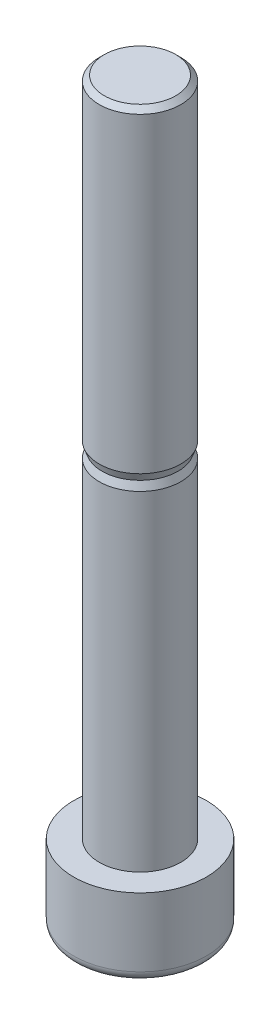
ISO-10303-21;
HEADER;
FILE_DESCRIPTION(('STEP AP214'),'2;1');
FILE_NAME('part.step','',(''),(''),'','','');
FILE_SCHEMA(('AUTOMOTIVE_DESIGN { 1 0 10303 214 1 1 1 1 }'));
ENDSEC;
DATA;
#1=APPLICATION_CONTEXT('core data for automotive mechanical design processes');
#2=APPLICATION_PROTOCOL_DEFINITION('international standard','automotive_design',2000,#1);
#3=PRODUCT_CONTEXT('',#1,'mechanical');
#4=PRODUCT('Part','Part','',(#3));
#5=PRODUCT_RELATED_PRODUCT_CATEGORY('part','',(#4));
#6=PRODUCT_DEFINITION_FORMATION('','',#4);
#7=PRODUCT_DEFINITION_CONTEXT('part definition',#1,'design');
#8=PRODUCT_DEFINITION('design','',#6,#7);
#9=PRODUCT_DEFINITION_SHAPE('','',#8);
#10=(LENGTH_UNIT() NAMED_UNIT(*) SI_UNIT(.MILLI.,.METRE.));
#11=(NAMED_UNIT(*) PLANE_ANGLE_UNIT() SI_UNIT($,.RADIAN.));
#12=(NAMED_UNIT(*) SI_UNIT($,.STERADIAN.) SOLID_ANGLE_UNIT());
#13=UNCERTAINTY_MEASURE_WITH_UNIT(LENGTH_MEASURE(1.E-05),#10,'distance_accuracy_value','');
#14=(GEOMETRIC_REPRESENTATION_CONTEXT(3) GLOBAL_UNCERTAINTY_ASSIGNED_CONTEXT((#13)) GLOBAL_UNIT_ASSIGNED_CONTEXT((#10,
#11,#12)) REPRESENTATION_CONTEXT('',''));
#15=CARTESIAN_POINT('',(0.,0.,0.));
#16=DIRECTION('',(0.,0.,1.));
#17=DIRECTION('',(1.,0.,0.));
#18=AXIS2_PLACEMENT_3D('',#15,#16,#17);
#19=CARTESIAN_POINT('',(0.,72.5,0.));
#20=DIRECTION('',(0.,1.,0.));
#21=DIRECTION('',(0.,0.,1.));
#22=AXIS2_PLACEMENT_3D('',#19,#20,#21);
#23=PLANE('',#22);
#24=CARTESIAN_POINT('',(0.,72.5,0.));
#25=DIRECTION('',(0.,-1.,0.));
#26=DIRECTION('',(0.,0.,-1.));
#27=AXIS2_PLACEMENT_3D('',#24,#25,#26);
#28=CIRCLE('',#27,3.5);
#29=CARTESIAN_POINT('',(0.,72.5,-3.5));
#30=VERTEX_POINT('',#29);
#31=EDGE_CURVE('E149',#30,#30,#28,.T.);
#32=ORIENTED_EDGE('',*,*,#31,.F.);
#33=EDGE_LOOP('',(#32));
#34=FACE_BOUND('',#33,.T.);
#35=ADVANCED_FACE('F47',(#34),#23,.T.);
#36=CARTESIAN_POINT('',(0.,72.,0.));
#37=DIRECTION('',(0.,-1.,0.));
#38=DIRECTION('',(0.,0.,-1.));
#39=AXIS2_PLACEMENT_3D('',#36,#37,#38);
#40=CONICAL_SURFACE('',#39,4.,0.785398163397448);
#41=ORIENTED_EDGE('',*,*,#31,.T.);
#42=EDGE_LOOP('',(#41));
#43=FACE_BOUND('',#42,.T.);
#44=CARTESIAN_POINT('',(0.,72.,0.));
#45=DIRECTION('',(0.,-1.,0.));
#46=DIRECTION('',(0.,0.,-1.));
#47=AXIS2_PLACEMENT_3D('',#44,#45,#46);
#48=CIRCLE('',#47,4.);
#49=CARTESIAN_POINT('',(0.,72.,-4.));
#50=VERTEX_POINT('',#49);
#51=EDGE_CURVE('E146',#50,#50,#48,.T.);
#52=ORIENTED_EDGE('',*,*,#51,.F.);
#53=EDGE_LOOP('',(#52));
#54=FACE_BOUND('',#53,.T.);
#55=ADVANCED_FACE('F177',(#43,#54),#40,.T.);
#56=CARTESIAN_POINT('',(0.,0.,0.));
#57=DIRECTION('',(0.,-1.,0.));
#58=DIRECTION('',(0.,0.,-1.));
#59=AXIS2_PLACEMENT_3D('',#56,#57,#58);
#60=CYLINDRICAL_SURFACE('',#59,4.);
#61=ORIENTED_EDGE('',*,*,#51,.T.);
#62=EDGE_LOOP('',(#61));
#63=FACE_BOUND('',#62,.T.);
#64=CARTESIAN_POINT('',(0.,41.5,0.));
#65=DIRECTION('',(0.,-1.,0.));
#66=DIRECTION('',(0.,0.,-1.));
#67=AXIS2_PLACEMENT_3D('',#64,#65,#66);
#68=CIRCLE('',#67,4.);
#69=CARTESIAN_POINT('',(0.,41.5,-4.));
#70=VERTEX_POINT('',#69);
#71=EDGE_CURVE('E143',#70,#70,#68,.T.);
#72=ORIENTED_EDGE('',*,*,#71,.F.);
#73=EDGE_LOOP('',(#72));
#74=FACE_BOUND('',#73,.T.);
#75=ADVANCED_FACE('F183',(#63,#74),#60,.T.);
#76=CARTESIAN_POINT('',(0.,40.75,0.));
#77=DIRECTION('',(0.,1.,0.));
#78=DIRECTION('',(0.,0.,1.));
#79=AXIS2_PLACEMENT_3D('',#76,#77,#78);
#80=CONICAL_SURFACE('',#79,3.72702232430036,0.34906585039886);
#81=ORIENTED_EDGE('',*,*,#71,.T.);
#82=EDGE_LOOP('',(#81));
#83=FACE_BOUND('',#82,.T.);
#84=CARTESIAN_POINT('',(0.,40.75,0.));
#85=DIRECTION('',(0.,-1.,0.));
#86=DIRECTION('',(0.,0.,-1.));
#87=AXIS2_PLACEMENT_3D('',#84,#85,#86);
#88=CIRCLE('',#87,3.72702232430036);
#89=CARTESIAN_POINT('',(0.,40.75,-3.72702232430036));
#90=VERTEX_POINT('',#89);
#91=EDGE_CURVE('E140',#90,#90,#88,.T.);
#92=ORIENTED_EDGE('',*,*,#91,.F.);
#93=EDGE_LOOP('',(#92));
#94=FACE_BOUND('',#93,.T.);
#95=ADVANCED_FACE('F190',(#83,#94),#80,.T.);
#96=CARTESIAN_POINT('',(0.,40.,0.));
#97=DIRECTION('',(0.,-1.,0.));
#98=DIRECTION('',(0.,0.,-1.));
#99=AXIS2_PLACEMENT_3D('',#96,#97,#98);
#100=CONICAL_SURFACE('',#99,4.,0.349065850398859);
#101=ORIENTED_EDGE('',*,*,#91,.T.);
#102=EDGE_LOOP('',(#101));
#103=FACE_BOUND('',#102,.T.);
#104=CARTESIAN_POINT('',(0.,40.,0.));
#105=DIRECTION('',(0.,-1.,0.));
#106=DIRECTION('',(0.,0.,-1.));
#107=AXIS2_PLACEMENT_3D('',#104,#105,#106);
#108=CIRCLE('',#107,4.);
#109=CARTESIAN_POINT('',(0.,40.,-4.));
#110=VERTEX_POINT('',#109);
#111=EDGE_CURVE('E137',#110,#110,#108,.T.);
#112=ORIENTED_EDGE('',*,*,#111,.F.);
#113=EDGE_LOOP('',(#112));
#114=FACE_BOUND('',#113,.T.);
#115=ADVANCED_FACE('F194',(#103,#114),#100,.T.);
#116=CARTESIAN_POINT('',(0.,0.,0.));
#117=DIRECTION('',(0.,-1.,0.));
#118=DIRECTION('',(0.,0.,-1.));
#119=AXIS2_PLACEMENT_3D('',#116,#117,#118);
#120=CYLINDRICAL_SURFACE('',#119,4.00000000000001);
#121=ORIENTED_EDGE('',*,*,#111,.T.);
#122=EDGE_LOOP('',(#121));
#123=FACE_BOUND('',#122,.T.);
#124=CARTESIAN_POINT('',(0.,7.7,0.));
#125=DIRECTION('',(0.,-1.,0.));
#126=DIRECTION('',(0.,0.,-1.));
#127=AXIS2_PLACEMENT_3D('',#124,#125,#126);
#128=CIRCLE('',#127,4.00000000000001);
#129=CARTESIAN_POINT('',(0.,7.7,-4.00000000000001));
#130=VERTEX_POINT('',#129);
#131=EDGE_CURVE('E134',#130,#130,#128,.T.);
#132=ORIENTED_EDGE('',*,*,#131,.F.);
#133=EDGE_LOOP('',(#132));
#134=FACE_BOUND('',#133,.T.);
#135=ADVANCED_FACE('F198',(#123,#134),#120,.T.);
#136=CARTESIAN_POINT('',(0.,7.7,-4.00000000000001));
#137=DIRECTION('',(0.,1.,0.));
#138=DIRECTION('',(0.,0.,1.));
#139=AXIS2_PLACEMENT_3D('',#136,#137,#138);
#140=PLANE('',#139);
#141=ORIENTED_EDGE('',*,*,#131,.T.);
#142=EDGE_LOOP('',(#141));
#143=FACE_BOUND('',#142,.T.);
#144=CARTESIAN_POINT('',(0.,7.7,0.));
#145=DIRECTION('',(0.,-1.,0.));
#146=DIRECTION('',(0.,0.,-1.));
#147=AXIS2_PLACEMENT_3D('',#144,#145,#146);
#148=CIRCLE('',#147,6.5);
#149=CARTESIAN_POINT('',(0.,7.7,-6.5));
#150=VERTEX_POINT('',#149);
#151=EDGE_CURVE('E131',#150,#150,#148,.T.);
#152=ORIENTED_EDGE('',*,*,#151,.F.);
#153=EDGE_LOOP('',(#152));
#154=FACE_BOUND('',#153,.T.);
#155=ADVANCED_FACE('F172',(#143,#154),#140,.T.);
#156=CARTESIAN_POINT('',(0.,0.,0.));
#157=DIRECTION('',(0.,-1.,0.));
#158=DIRECTION('',(0.,0.,-1.));
#159=AXIS2_PLACEMENT_3D('',#156,#157,#158);
#160=CYLINDRICAL_SURFACE('',#159,6.5);
#161=CARTESIAN_POINT('',(0.,1.,0.));
#162=DIRECTION('',(0.,-1.,0.));
#163=DIRECTION('',(0.,0.,-1.));
#164=AXIS2_PLACEMENT_3D('',#161,#162,#163);
#165=CIRCLE('',#164,6.5);
#166=CARTESIAN_POINT('',(0.,1.,-6.5));
#167=VERTEX_POINT('',#166);
#168=EDGE_CURVE('E61',#167,#167,#165,.F.);
#169=ORIENTED_EDGE('',*,*,#168,.T.);
#170=EDGE_LOOP('',(#169));
#171=FACE_BOUND('',#170,.T.);
#172=ORIENTED_EDGE('',*,*,#151,.T.);
#173=EDGE_LOOP('',(#172));
#174=FACE_BOUND('',#173,.T.);
#175=ADVANCED_FACE('F157',(#171,#174),#160,.T.);
#176=CARTESIAN_POINT('',(0.,0.,0.));
#177=DIRECTION('',(0.,-1.,0.));
#178=DIRECTION('',(0.,0.,-1.));
#179=AXIS2_PLACEMENT_3D('',#176,#177,#178);
#180=PLANE('',#179);
#181=CARTESIAN_POINT('',(0.,0.,0.));
#182=DIRECTION('',(0.,1.,0.));
#183=DIRECTION('',(0.,0.,1.));
#184=AXIS2_PLACEMENT_3D('',#181,#182,#183);
#185=CIRCLE('',#184,3.5);
#186=CARTESIAN_POINT('',(0.,0.,3.5));
#187=VERTEX_POINT('',#186);
#188=EDGE_CURVE('E392',#187,#187,#185,.T.);
#189=ORIENTED_EDGE('',*,*,#188,.T.);
#190=EDGE_LOOP('',(#189));
#191=FACE_BOUND('',#190,.T.);
#192=CARTESIAN_POINT('',(0.,0.,0.));
#193=DIRECTION('',(0.,-1.,0.));
#194=DIRECTION('',(0.,0.,-1.));
#195=AXIS2_PLACEMENT_3D('',#192,#193,#194);
#196=CIRCLE('',#195,5.5);
#197=CARTESIAN_POINT('',(0.,0.,-5.5));
#198=VERTEX_POINT('',#197);
#199=EDGE_CURVE('E152',#198,#198,#196,.T.);
#200=ORIENTED_EDGE('',*,*,#199,.T.);
#201=EDGE_LOOP('',(#200));
#202=FACE_BOUND('',#201,.T.);
#203=ADVANCED_FACE('F162',(#191,#202),#180,.T.);
#204=CARTESIAN_POINT('',(0.,1.,0.));
#205=DIRECTION('',(0.,-1.,0.));
#206=DIRECTION('',(0.,0.,-1.));
#207=AXIS2_PLACEMENT_3D('',#204,#205,#206);
#208=TOROIDAL_SURFACE('',#207,5.5,1.);
#209=ORIENTED_EDGE('',*,*,#168,.F.);
#210=EDGE_LOOP('',(#209));
#211=FACE_BOUND('',#210,.T.);
#212=ORIENTED_EDGE('',*,*,#199,.F.);
#213=EDGE_LOOP('',(#212));
#214=FACE_BOUND('',#213,.T.);
#215=ADVANCED_FACE('F49',(#211,#214),#208,.T.);
#216=CARTESIAN_POINT('',(0.,0.352653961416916,0.));
#217=DIRECTION('',(0.,-1.,0.));
#218=DIRECTION('',(0.,0.,-1.));
#219=AXIS2_PLACEMENT_3D('',#216,#217,#218);
#220=CONICAL_SURFACE('',#219,1.5,1.39626340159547);
#221=ORIENTED_EDGE('',*,*,#188,.F.);
#222=EDGE_LOOP('',(#221));
#223=FACE_BOUND('',#222,.T.);
#224=CARTESIAN_POINT('',(3.46421708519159,0.00630949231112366,-0.000199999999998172));
#225=CARTESIAN_POINT('',(3.39214374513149,0.0190244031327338,0.124634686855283));
#226=CARTESIAN_POINT('',(3.32001326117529,0.0305515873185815,0.24956834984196));
#227=CARTESIAN_POINT('',(3.17564180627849,0.0507849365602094,0.499627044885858));
#228=CARTESIAN_POINT('',(3.10340081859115,0.0594906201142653,0.624752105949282));
#229=CARTESIAN_POINT('',(2.95899908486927,0.0736148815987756,0.87486324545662));
#230=CARTESIAN_POINT('',(2.88683852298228,0.0790407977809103,0.9998490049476));
#231=CARTESIAN_POINT('',(2.74247737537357,0.0863149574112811,1.24988984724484));
#232=CARTESIAN_POINT('',(2.67027679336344,0.0881634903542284,1.37494492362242));
#233=CARTESIAN_POINT('',(2.52587562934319,0.0881634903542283,1.62505507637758));
#234=CARTESIAN_POINT('',(2.45367504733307,0.086314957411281,1.75011015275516));
#235=CARTESIAN_POINT('',(2.30931389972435,0.0790407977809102,2.0001509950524));
#236=CARTESIAN_POINT('',(2.23715333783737,0.0736148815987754,2.12513675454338));
#237=CARTESIAN_POINT('',(2.09275160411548,0.059490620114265,2.37524789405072));
#238=CARTESIAN_POINT('',(2.02051061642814,0.0507849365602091,2.50037295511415));
#239=CARTESIAN_POINT('',(1.87613916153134,0.0305515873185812,2.75043165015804));
#240=CARTESIAN_POINT('',(1.80400867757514,0.0190244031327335,2.87536531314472));
#241=CARTESIAN_POINT('',(1.73193533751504,0.00630949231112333,3.0002));
#242=B_SPLINE_CURVE_WITH_KNOTS('',3,(#224,#225,#226,#227,#228,#229,#230,#231,#232,#233,#234,
#235,#236,#237,#238,#239,#240,#241),.UNSPECIFIED.,.F.,.F.,(4,2,2,2,2,2,2,2,4),(0.,
0.434128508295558,0.868331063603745,1.30155848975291,1.73475085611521,2.16794322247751,
2.60117064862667,3.03537320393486,3.46950171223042),.UNSPECIFIED.);
#243=CARTESIAN_POINT('',(3.46410161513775,0.00632985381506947,0.));
#244=VERTEX_POINT('',#243);
#245=CARTESIAN_POINT('',(1.73205080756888,0.00632985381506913,3.));
#246=VERTEX_POINT('',#245);
#247=EDGE_CURVE('E115',#244,#246,#242,.T.);
#248=ORIENTED_EDGE('',*,*,#247,.F.);
#249=CARTESIAN_POINT('',(1.73193533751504,0.00630949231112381,-3.0002));
#250=CARTESIAN_POINT('',(1.80400867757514,0.0190244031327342,-2.87536531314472));
#251=CARTESIAN_POINT('',(1.87613916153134,0.0305515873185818,-2.75043165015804));
#252=CARTESIAN_POINT('',(2.02051061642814,0.0507849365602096,-2.50037295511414));
#253=CARTESIAN_POINT('',(2.09275160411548,0.0594906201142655,-2.37524789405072));
#254=CARTESIAN_POINT('',(2.23715333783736,0.0736148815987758,-2.12513675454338));
#255=CARTESIAN_POINT('',(2.30931389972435,0.0790407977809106,-2.0001509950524));
#256=CARTESIAN_POINT('',(2.45367504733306,0.0863149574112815,-1.75011015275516));
#257=CARTESIAN_POINT('',(2.52587562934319,0.0881634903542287,-1.62505507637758));
#258=CARTESIAN_POINT('',(2.67027679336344,0.0881634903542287,-1.37494492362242));
#259=CARTESIAN_POINT('',(2.74247737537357,0.0863149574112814,-1.24988984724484));
#260=CARTESIAN_POINT('',(2.88683852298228,0.0790407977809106,-0.999849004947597));
#261=CARTESIAN_POINT('',(2.95899908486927,0.0736148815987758,-0.874863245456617));
#262=CARTESIAN_POINT('',(3.10340081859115,0.0594906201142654,-0.624752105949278));
#263=CARTESIAN_POINT('',(3.17564180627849,0.0507849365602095,-0.499627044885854));
#264=CARTESIAN_POINT('',(3.32001326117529,0.0305515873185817,-0.249568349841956));
#265=CARTESIAN_POINT('',(3.39214374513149,0.019024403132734,-0.124634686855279));
#266=CARTESIAN_POINT('',(3.46421708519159,0.00630949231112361,0.000200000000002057));
#267=B_SPLINE_CURVE_WITH_KNOTS('',3,(#249,#250,#251,#252,#253,#254,#255,#256,#257,#258,#259,
#260,#261,#262,#263,#264,#265,#266),.UNSPECIFIED.,.F.,.F.,(4,2,2,2,2,2,2,2,4),(0.,
0.434128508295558,0.868331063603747,1.30155848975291,1.73475085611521,2.16794322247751,
2.60117064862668,3.03537320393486,3.46950171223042),.UNSPECIFIED.);
#268=CARTESIAN_POINT('',(1.73205080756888,0.00632985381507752,-3.));
#269=VERTEX_POINT('',#268);
#270=EDGE_CURVE('E378',#269,#244,#267,.T.);
#271=ORIENTED_EDGE('',*,*,#270,.F.);
#272=CARTESIAN_POINT('',(-5.2142566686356,-0.443583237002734,-3.));
#273=CARTESIAN_POINT('',(-5.08848970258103,-0.42436307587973,-3.));
#274=CARTESIAN_POINT('',(-4.96269742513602,-0.405308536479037,-3.));
#275=CARTESIAN_POINT('',(-4.71105190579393,-0.367600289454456,-3.));
#276=CARTESIAN_POINT('',(-4.58519866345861,-0.348946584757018,-3.));
#277=CARTESIAN_POINT('',(-4.20751302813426,-0.293688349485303,-3.));
#278=CARTESIAN_POINT('',(-3.95557640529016,-0.257790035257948,-3.));
#279=CARTESIAN_POINT('',(-3.45031072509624,-0.188560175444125,-3.));
#280=CARTESIAN_POINT('',(-3.19698015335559,-0.155239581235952,-3.));
#281=CARTESIAN_POINT('',(-2.68980714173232,-0.092607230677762,-3.));
#282=CARTESIAN_POINT('',(-2.43596468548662,-0.0632956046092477,-3.));
#283=CARTESIAN_POINT('',(-1.93069818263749,-0.0108964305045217,-3.));
#284=CARTESIAN_POINT('',(-1.67928163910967,0.0122615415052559,-3.));
#285=CARTESIAN_POINT('',(-1.17583088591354,0.0503923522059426,-3.));
#286=CARTESIAN_POINT('',(-0.923796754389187,0.0653661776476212,-3.));
#287=CARTESIAN_POINT('',(-0.419782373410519,0.0847597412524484,-3.));
#288=CARTESIAN_POINT('',(-0.167802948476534,0.0891996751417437,-3.));
#289=CARTESIAN_POINT('',(0.336103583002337,0.0867111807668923,-3.));
#290=CARTESIAN_POINT('',(0.588030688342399,0.0797825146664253,-3.));
#291=CARTESIAN_POINT('',(1.02218964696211,0.0591680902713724,-3.));
#292=CARTESIAN_POINT('',(1.20454344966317,0.0478633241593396,-3.));
#293=CARTESIAN_POINT('',(1.5689227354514,0.0209040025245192,-3.));
#294=CARTESIAN_POINT('',(1.75094822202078,0.00524949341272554,-3.));
#295=CARTESIAN_POINT('',(2.11491570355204,-0.0295067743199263,-3.));
#296=CARTESIAN_POINT('',(2.29685724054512,-0.0486132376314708,-3.));
#297=CARTESIAN_POINT('',(2.66044678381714,-0.0894482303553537,-3.));
#298=CARTESIAN_POINT('',(2.84209478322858,-0.111176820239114,-3.));
#299=CARTESIAN_POINT('',(3.20678445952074,-0.156825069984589,-3.));
#300=CARTESIAN_POINT('',(3.38982385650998,-0.180762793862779,-3.));
#301=CARTESIAN_POINT('',(3.7556956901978,-0.230169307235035,-3.));
#302=CARTESIAN_POINT('',(3.9385281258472,-0.255638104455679,-3.));
#303=CARTESIAN_POINT('',(4.30358860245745,-0.30767871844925,-3.));
#304=CARTESIAN_POINT('',(4.48581704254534,-0.33424774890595,-3.));
#305=CARTESIAN_POINT('',(4.85013313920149,-0.388295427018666,-3.));
#306=CARTESIAN_POINT('',(5.03222080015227,-0.415774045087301,-3.));
#307=CARTESIAN_POINT('',(5.2142566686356,-0.443583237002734,-3.));
#308=B_SPLINE_CURVE_WITH_KNOTS('',3,(#272,#273,#274,#275,#276,#277,#278,#279,#280,#281,#282,
#283,#284,#285,#286,#287,#288,#289,#290,#291,#292,#293,#294,#295,#296,#297,#298,#299,#300,#301,
#302,#303,#304,#305,#306,#307),.UNSPECIFIED.,.F.,.F.,(4,2,2,2,2,2,2,2,2,2,2,2,2,2,2,2,2,4),(0.,
0.381681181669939,0.76336514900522,1.52679888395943,2.29331574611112,3.05985751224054,
3.81720689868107,4.57446495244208,5.33027000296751,6.08609086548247,6.6341460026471,
7.18219529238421,7.73099723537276,8.27981183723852,8.83359762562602,9.38738620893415,
9.93984914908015,10.4922941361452),.UNSPECIFIED.);
#309=CARTESIAN_POINT('',(-1.73205080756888,0.00632985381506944,-3.));
#310=VERTEX_POINT('',#309);
#311=EDGE_CURVE('E373',#310,#269,#308,.T.);
#312=ORIENTED_EDGE('',*,*,#311,.F.);
#313=CARTESIAN_POINT('',(-3.46421708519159,0.00630949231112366,0.000200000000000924));
#314=CARTESIAN_POINT('',(-3.39214374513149,0.019024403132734,-0.12463468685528));
#315=CARTESIAN_POINT('',(-3.32001326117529,0.0305515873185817,-0.249568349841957));
#316=CARTESIAN_POINT('',(-3.17564180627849,0.0507849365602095,-0.499627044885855));
#317=CARTESIAN_POINT('',(-3.10340081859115,0.0594906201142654,-0.624752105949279));
#318=CARTESIAN_POINT('',(-2.95899908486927,0.0736148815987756,-0.874863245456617));
#319=CARTESIAN_POINT('',(-2.88683852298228,0.0790407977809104,-0.999849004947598));
#320=CARTESIAN_POINT('',(-2.74247737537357,0.0863149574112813,-1.24988984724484));
#321=CARTESIAN_POINT('',(-2.67027679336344,0.0881634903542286,-1.37494492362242));
#322=CARTESIAN_POINT('',(-2.52587562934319,0.0881634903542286,-1.62505507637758));
#323=CARTESIAN_POINT('',(-2.45367504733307,0.0863149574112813,-1.75011015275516));
#324=CARTESIAN_POINT('',(-2.30931389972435,0.0790407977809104,-2.0001509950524));
#325=CARTESIAN_POINT('',(-2.23715333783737,0.0736148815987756,-2.12513675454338));
#326=CARTESIAN_POINT('',(-2.09275160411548,0.0594906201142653,-2.37524789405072));
#327=CARTESIAN_POINT('',(-2.02051061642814,0.0507849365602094,-2.50037295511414));
#328=CARTESIAN_POINT('',(-1.87613916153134,0.0305515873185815,-2.75043165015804));
#329=CARTESIAN_POINT('',(-1.80400867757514,0.0190244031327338,-2.87536531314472));
#330=CARTESIAN_POINT('',(-1.73193533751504,0.0063094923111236,-3.0002));
#331=B_SPLINE_CURVE_WITH_KNOTS('',3,(#313,#314,#315,#316,#317,#318,#319,#320,#321,#322,#323,
#324,#325,#326,#327,#328,#329,#330),.UNSPECIFIED.,.F.,.F.,(4,2,2,2,2,2,2,2,4),(0.,
0.434128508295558,0.868331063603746,1.30155848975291,1.73475085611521,2.16794322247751,
2.60117064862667,3.03537320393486,3.46950171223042),.UNSPECIFIED.);
#332=CARTESIAN_POINT('',(-3.46410161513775,0.00632985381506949,0.));
#333=VERTEX_POINT('',#332);
#334=EDGE_CURVE('E68',#333,#310,#331,.T.);
#335=ORIENTED_EDGE('',*,*,#334,.F.);
#336=CARTESIAN_POINT('',(-1.73193533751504,0.00630949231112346,3.0002));
#337=CARTESIAN_POINT('',(-1.80400867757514,0.0190244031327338,2.87536531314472));
#338=CARTESIAN_POINT('',(-1.87613916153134,0.0305515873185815,2.75043165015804));
#339=CARTESIAN_POINT('',(-2.02051061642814,0.0507849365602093,2.50037295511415));
#340=CARTESIAN_POINT('',(-2.09275160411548,0.0594906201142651,2.37524789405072));
#341=CARTESIAN_POINT('',(-2.23715333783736,0.0736148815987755,2.12513675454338));
#342=CARTESIAN_POINT('',(-2.30931389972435,0.0790407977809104,2.0001509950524));
#343=CARTESIAN_POINT('',(-2.45367504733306,0.0863149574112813,1.75011015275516));
#344=CARTESIAN_POINT('',(-2.52587562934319,0.0881634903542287,1.62505507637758));
#345=CARTESIAN_POINT('',(-2.67027679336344,0.0881634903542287,1.37494492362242));
#346=CARTESIAN_POINT('',(-2.74247737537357,0.0863149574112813,1.24988984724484));
#347=CARTESIAN_POINT('',(-2.88683852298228,0.0790407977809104,0.999849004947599));
#348=CARTESIAN_POINT('',(-2.95899908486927,0.0736148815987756,0.874863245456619));
#349=CARTESIAN_POINT('',(-3.10340081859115,0.0594906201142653,0.62475210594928));
#350=CARTESIAN_POINT('',(-3.17564180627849,0.0507849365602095,0.499627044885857));
#351=CARTESIAN_POINT('',(-3.32001326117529,0.0305515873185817,0.249568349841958));
#352=CARTESIAN_POINT('',(-3.39214374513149,0.0190244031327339,0.124634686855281));
#353=CARTESIAN_POINT('',(-3.46421708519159,0.00630949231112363,-0.000199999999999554));
#354=B_SPLINE_CURVE_WITH_KNOTS('',3,(#336,#337,#338,#339,#340,#341,#342,#343,#344,#345,#346,
#347,#348,#349,#350,#351,#352,#353),.UNSPECIFIED.,.F.,.F.,(4,2,2,2,2,2,2,2,4),(0.,
0.434128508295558,0.868331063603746,1.30155848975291,1.73475085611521,2.16794322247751,
2.60117064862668,3.03537320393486,3.46950171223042),.UNSPECIFIED.);
#355=CARTESIAN_POINT('',(-1.73205080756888,0.00632985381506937,3.));
#356=VERTEX_POINT('',#355);
#357=EDGE_CURVE('E11',#356,#333,#354,.T.);
#358=ORIENTED_EDGE('',*,*,#357,.F.);
#359=CARTESIAN_POINT('',(5.21425666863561,-0.443583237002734,3.));
#360=CARTESIAN_POINT('',(5.08848970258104,-0.424363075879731,3.));
#361=CARTESIAN_POINT('',(4.96269742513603,-0.405308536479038,3.));
#362=CARTESIAN_POINT('',(4.71105190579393,-0.367600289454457,3.));
#363=CARTESIAN_POINT('',(4.58519866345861,-0.348946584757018,3.));
#364=CARTESIAN_POINT('',(4.20751302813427,-0.293688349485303,3.));
#365=CARTESIAN_POINT('',(3.95557640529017,-0.257790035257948,3.));
#366=CARTESIAN_POINT('',(3.45031072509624,-0.188560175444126,3.));
#367=CARTESIAN_POINT('',(3.19698015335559,-0.155239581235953,3.));
#368=CARTESIAN_POINT('',(2.68980714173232,-0.0926072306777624,3.));
#369=CARTESIAN_POINT('',(2.43596468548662,-0.0632956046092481,3.));
#370=CARTESIAN_POINT('',(1.93069818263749,-0.010896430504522,3.));
#371=CARTESIAN_POINT('',(1.67928163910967,0.0122615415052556,3.));
#372=CARTESIAN_POINT('',(1.17583088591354,0.0503923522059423,3.));
#373=CARTESIAN_POINT('',(0.923796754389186,0.0653661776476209,3.));
#374=CARTESIAN_POINT('',(0.419782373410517,0.0847597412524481,3.));
#375=CARTESIAN_POINT('',(0.167802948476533,0.0891996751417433,3.));
#376=CARTESIAN_POINT('',(-0.336103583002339,0.0867111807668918,3.));
#377=CARTESIAN_POINT('',(-0.588030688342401,0.0797825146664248,3.));
#378=CARTESIAN_POINT('',(-1.02218964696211,0.059168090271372,3.));
#379=CARTESIAN_POINT('',(-1.20454344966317,0.0478633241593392,3.));
#380=CARTESIAN_POINT('',(-1.5689227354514,0.0209040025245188,3.));
#381=CARTESIAN_POINT('',(-1.75094822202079,0.00524949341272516,3.));
#382=CARTESIAN_POINT('',(-2.11491570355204,-0.0295067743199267,3.));
#383=CARTESIAN_POINT('',(-2.29685724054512,-0.0486132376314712,3.));
#384=CARTESIAN_POINT('',(-2.66044678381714,-0.089448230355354,3.));
#385=CARTESIAN_POINT('',(-2.84209478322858,-0.111176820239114,3.));
#386=CARTESIAN_POINT('',(-3.20678445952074,-0.15682506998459,3.));
#387=CARTESIAN_POINT('',(-3.38982385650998,-0.180762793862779,3.));
#388=CARTESIAN_POINT('',(-3.7556956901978,-0.230169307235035,3.));
#389=CARTESIAN_POINT('',(-3.93852812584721,-0.25563810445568,3.));
#390=CARTESIAN_POINT('',(-4.30358860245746,-0.30767871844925,3.));
#391=CARTESIAN_POINT('',(-4.48581704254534,-0.33424774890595,3.));
#392=CARTESIAN_POINT('',(-4.85013313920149,-0.388295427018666,3.));
#393=CARTESIAN_POINT('',(-5.03222080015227,-0.415774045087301,3.));
#394=CARTESIAN_POINT('',(-5.2142566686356,-0.443583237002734,3.));
#395=B_SPLINE_CURVE_WITH_KNOTS('',3,(#359,#360,#361,#362,#363,#364,#365,#366,#367,#368,#369,
#370,#371,#372,#373,#374,#375,#376,#377,#378,#379,#380,#381,#382,#383,#384,#385,#386,#387,#388,
#389,#390,#391,#392,#393,#394),.UNSPECIFIED.,.F.,.F.,(4,2,2,2,2,2,2,2,2,2,2,2,2,2,2,2,2,4),(0.,
0.381681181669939,0.76336514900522,1.52679888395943,2.29331574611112,3.05985751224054,
3.81720689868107,4.57446495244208,5.33027000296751,6.08609086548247,6.63414600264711,
7.18219529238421,7.73099723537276,8.27981183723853,8.83359762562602,9.38738620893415,
9.93984914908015,10.4922941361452),.UNSPECIFIED.);
#396=EDGE_CURVE('E106',#246,#356,#395,.T.);
#397=ORIENTED_EDGE('',*,*,#396,.F.);
#398=EDGE_LOOP('',(#248,#271,#312,#335,#358,#397));
#399=FACE_BOUND('',#398,.T.);
#400=ADVANCED_FACE('F105',(#223,#399),#220,.F.);
#401=CARTESIAN_POINT('',(0.,5.,0.));
#402=DIRECTION('',(0.,-1.,0.));
#403=DIRECTION('',(0.,0.,-1.));
#404=AXIS2_PLACEMENT_3D('',#401,#402,#403);
#405=PLANE('',#404);
#406=DIRECTION('',(-1.,0.,0.));
#407=VECTOR('',#406,1.);
#408=CARTESIAN_POINT('',(1.73205080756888,5.,3.));
#409=LINE('',#408,#407);
#410=CARTESIAN_POINT('',(1.73205080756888,5.,3.));
#411=VERTEX_POINT('',#410);
#412=CARTESIAN_POINT('',(-1.73205080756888,5.,3.));
#413=VERTEX_POINT('',#412);
#414=EDGE_CURVE('E114',#411,#413,#409,.T.);
#415=ORIENTED_EDGE('',*,*,#414,.T.);
#416=DIRECTION('',(-0.5,0.,-0.866025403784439));
#417=VECTOR('',#416,1.);
#418=CARTESIAN_POINT('',(-1.73205080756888,5.,3.));
#419=LINE('',#418,#417);
#420=CARTESIAN_POINT('',(-3.46410161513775,5.,0.));
#421=VERTEX_POINT('',#420);
#422=EDGE_CURVE('E119',#413,#421,#419,.T.);
#423=ORIENTED_EDGE('',*,*,#422,.T.);
#424=DIRECTION('',(0.5,0.,-0.866025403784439));
#425=VECTOR('',#424,1.);
#426=CARTESIAN_POINT('',(-3.46410161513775,5.,0.));
#427=LINE('',#426,#425);
#428=CARTESIAN_POINT('',(-1.73205080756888,5.,-3.));
#429=VERTEX_POINT('',#428);
#430=EDGE_CURVE('E408',#421,#429,#427,.T.);
#431=ORIENTED_EDGE('',*,*,#430,.T.);
#432=DIRECTION('',(1.,0.,0.));
#433=VECTOR('',#432,1.);
#434=CARTESIAN_POINT('',(-1.73205080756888,5.,-3.));
#435=LINE('',#434,#433);
#436=CARTESIAN_POINT('',(1.73205080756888,5.,-3.));
#437=VERTEX_POINT('',#436);
#438=EDGE_CURVE('E397',#429,#437,#435,.T.);
#439=ORIENTED_EDGE('',*,*,#438,.T.);
#440=DIRECTION('',(0.5,0.,0.866025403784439));
#441=VECTOR('',#440,1.);
#442=CARTESIAN_POINT('',(1.73205080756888,5.,-3.));
#443=LINE('',#442,#441);
#444=CARTESIAN_POINT('',(3.46410161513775,5.,0.));
#445=VERTEX_POINT('',#444);
#446=EDGE_CURVE('E127',#437,#445,#443,.T.);
#447=ORIENTED_EDGE('',*,*,#446,.T.);
#448=DIRECTION('',(-0.5,0.,0.866025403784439));
#449=VECTOR('',#448,1.);
#450=CARTESIAN_POINT('',(3.46410161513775,5.,0.));
#451=LINE('',#450,#449);
#452=EDGE_CURVE('E122',#445,#411,#451,.T.);
#453=ORIENTED_EDGE('',*,*,#452,.T.);
#454=EDGE_LOOP('',(#415,#423,#431,#439,#447,#453));
#455=FACE_BOUND('',#454,.T.);
#456=ADVANCED_FACE('F218',(#455),#405,.T.);
#457=CARTESIAN_POINT('',(-1.73205080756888,5.,3.));
#458=DIRECTION('',(-0.866025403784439,0.,0.5));
#459=DIRECTION('',(0.5,0.,0.866025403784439));
#460=AXIS2_PLACEMENT_3D('',#457,#458,#459);
#461=PLANE('',#460);
#462=DIRECTION('',(0.,-1.,0.));
#463=VECTOR('',#462,1.);
#464=CARTESIAN_POINT('',(-1.73205080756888,5.,3.));
#465=LINE('',#464,#463);
#466=EDGE_CURVE('E112',#413,#356,#465,.T.);
#467=ORIENTED_EDGE('',*,*,#466,.T.);
#468=ORIENTED_EDGE('',*,*,#357,.T.);
#469=DIRECTION('',(0.,-1.,0.));
#470=VECTOR('',#469,1.);
#471=CARTESIAN_POINT('',(-3.46410161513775,5.,0.));
#472=LINE('',#471,#470);
#473=EDGE_CURVE('E121',#421,#333,#472,.T.);
#474=ORIENTED_EDGE('',*,*,#473,.F.);
#475=ORIENTED_EDGE('',*,*,#422,.F.);
#476=EDGE_LOOP('',(#467,#468,#474,#475));
#477=FACE_BOUND('',#476,.T.);
#478=ADVANCED_FACE('F117',(#477),#461,.F.);
#479=CARTESIAN_POINT('',(-3.46410161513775,5.,0.));
#480=DIRECTION('',(-0.866025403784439,0.,-0.5));
#481=DIRECTION('',(-0.5,0.,0.866025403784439));
#482=AXIS2_PLACEMENT_3D('',#479,#480,#481);
#483=PLANE('',#482);
#484=ORIENTED_EDGE('',*,*,#473,.T.);
#485=ORIENTED_EDGE('',*,*,#334,.T.);
#486=DIRECTION('',(0.,-1.,0.));
#487=VECTOR('',#486,1.);
#488=CARTESIAN_POINT('',(-1.73205080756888,5.,-3.));
#489=LINE('',#488,#487);
#490=EDGE_CURVE('E124',#429,#310,#489,.T.);
#491=ORIENTED_EDGE('',*,*,#490,.F.);
#492=ORIENTED_EDGE('',*,*,#430,.F.);
#493=EDGE_LOOP('',(#484,#485,#491,#492));
#494=FACE_BOUND('',#493,.T.);
#495=ADVANCED_FACE('F247',(#494),#483,.F.);
#496=CARTESIAN_POINT('',(-1.73205080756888,5.,-3.));
#497=DIRECTION('',(0.,0.,-1.));
#498=DIRECTION('',(-1.,0.,0.));
#499=AXIS2_PLACEMENT_3D('',#496,#497,#498);
#500=PLANE('',#499);
#501=ORIENTED_EDGE('',*,*,#490,.T.);
#502=ORIENTED_EDGE('',*,*,#311,.T.);
#503=DIRECTION('',(0.,-1.,0.));
#504=VECTOR('',#503,1.);
#505=CARTESIAN_POINT('',(1.73205080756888,5.,-3.));
#506=LINE('',#505,#504);
#507=EDGE_CURVE('E399',#437,#269,#506,.T.);
#508=ORIENTED_EDGE('',*,*,#507,.F.);
#509=ORIENTED_EDGE('',*,*,#438,.F.);
#510=EDGE_LOOP('',(#501,#502,#508,#509));
#511=FACE_BOUND('',#510,.T.);
#512=ADVANCED_FACE('F254',(#511),#500,.F.);
#513=CARTESIAN_POINT('',(1.73205080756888,5.,-3.));
#514=DIRECTION('',(0.866025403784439,0.,-0.5));
#515=DIRECTION('',(-0.5,0.,-0.866025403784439));
#516=AXIS2_PLACEMENT_3D('',#513,#514,#515);
#517=PLANE('',#516);
#518=ORIENTED_EDGE('',*,*,#507,.T.);
#519=ORIENTED_EDGE('',*,*,#270,.T.);
#520=DIRECTION('',(0.,-1.,0.));
#521=VECTOR('',#520,1.);
#522=CARTESIAN_POINT('',(3.46410161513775,5.,0.));
#523=LINE('',#522,#521);
#524=EDGE_CURVE('E400',#445,#244,#523,.T.);
#525=ORIENTED_EDGE('',*,*,#524,.F.);
#526=ORIENTED_EDGE('',*,*,#446,.F.);
#527=EDGE_LOOP('',(#518,#519,#525,#526));
#528=FACE_BOUND('',#527,.T.);
#529=ADVANCED_FACE('F263',(#528),#517,.F.);
#530=CARTESIAN_POINT('',(3.46410161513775,5.,0.));
#531=DIRECTION('',(0.866025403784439,0.,0.5));
#532=DIRECTION('',(0.5,0.,-0.866025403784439));
#533=AXIS2_PLACEMENT_3D('',#530,#531,#532);
#534=PLANE('',#533);
#535=ORIENTED_EDGE('',*,*,#524,.T.);
#536=ORIENTED_EDGE('',*,*,#247,.T.);
#537=DIRECTION('',(0.,-1.,0.));
#538=VECTOR('',#537,1.);
#539=CARTESIAN_POINT('',(1.73205080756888,5.,3.));
#540=LINE('',#539,#538);
#541=EDGE_CURVE('E75',#411,#246,#540,.T.);
#542=ORIENTED_EDGE('',*,*,#541,.F.);
#543=ORIENTED_EDGE('',*,*,#452,.F.);
#544=EDGE_LOOP('',(#535,#536,#542,#543));
#545=FACE_BOUND('',#544,.T.);
#546=ADVANCED_FACE('F272',(#545),#534,.F.);
#547=CARTESIAN_POINT('',(1.73205080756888,5.,3.));
#548=DIRECTION('',(0.,0.,1.));
#549=DIRECTION('',(1.,0.,0.));
#550=AXIS2_PLACEMENT_3D('',#547,#548,#549);
#551=PLANE('',#550);
#552=ORIENTED_EDGE('',*,*,#541,.T.);
#553=ORIENTED_EDGE('',*,*,#396,.T.);
#554=ORIENTED_EDGE('',*,*,#466,.F.);
#555=ORIENTED_EDGE('',*,*,#414,.F.);
#556=EDGE_LOOP('',(#552,#553,#554,#555));
#557=FACE_BOUND('',#556,.T.);
#558=ADVANCED_FACE('F111',(#557),#551,.F.);
#559=CLOSED_SHELL('',(#35,#55,#75,#95,#115,#135,#155,#175,#203,#215,#400,#456,#478,#495,#512,
#529,#546,#558));
#560=MANIFOLD_SOLID_BREP('B2',#559);
#561=ADVANCED_BREP_SHAPE_REPRESENTATION('',(#18,#560),#14);
#562=SHAPE_DEFINITION_REPRESENTATION(#9,#561);
ENDSEC;
END-ISO-10303-21;
